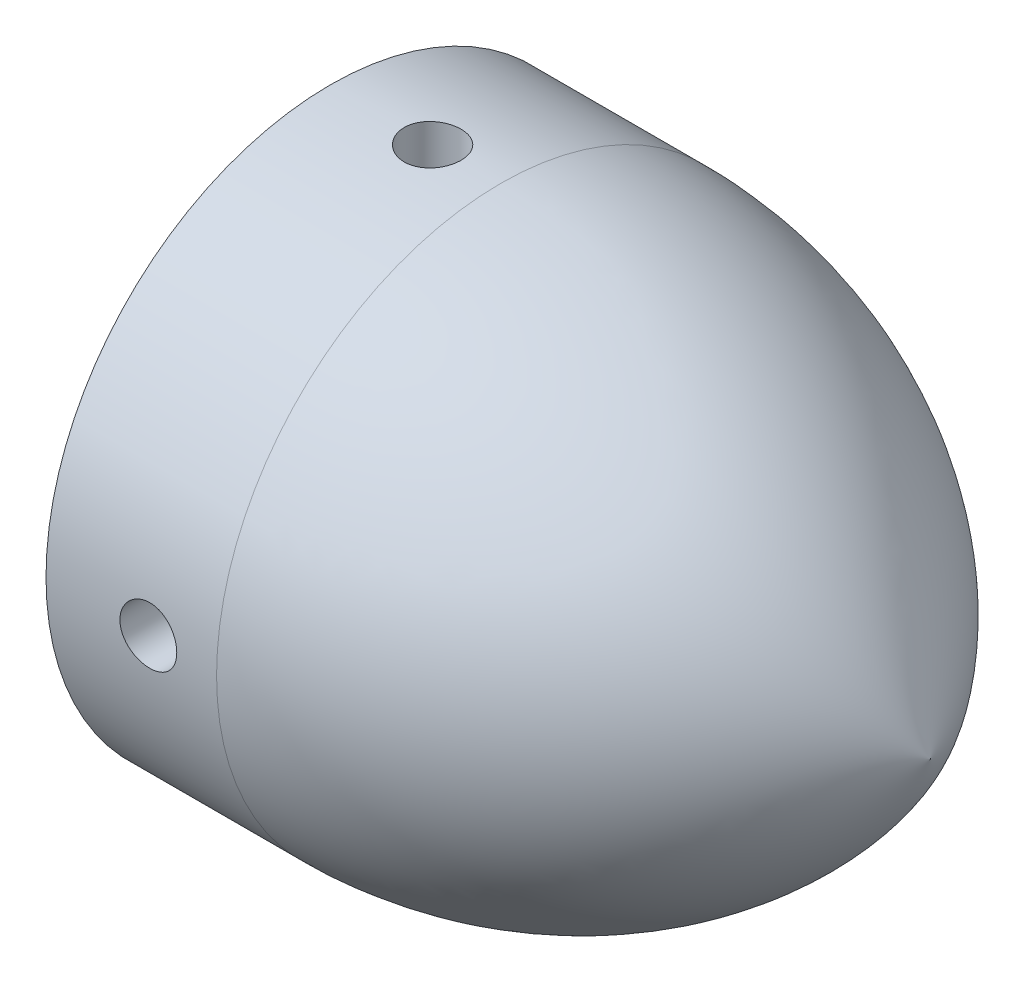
from build123d import *

# Parameters (mm, degrees)
SKETCH2_R             = 40
EXTRUDE1_DEPTH        = 10
M8_TAPPED_HOLE1_D     = 6.8
M8_TAPPED_HOLE1_DEPTH = 20
M8_TAPPED_HOLE1_TIP   = 2.042926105
SKETCH5_R             = 5
EXTRUDE2_DEPTH        = 20
CIRPATTERN1_COUNT     = 4


with BuildPart() as part:
    # Sketch1 → Revolve1 (revolve)
    with BuildSketch(Plane.XY, mode=Mode.PRIVATE) as revolve1_sk:
        with BuildLine():
            Line((0, 0), (105.498344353, 0))
            ThreePointArc((105.498344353, 0), (75.276925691, 36.366658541), (30, 50))
            Line((30, 50), (0, 50))
            Line((0, 50), (0, 0))
        make_face()
    revolve(revolve1_sk.sketch.rotate(Axis((0, 0, 0), (1, 0, 0)), 90), axis=Axis((0, 0, 0), (1, 0, 0)))

    # Sketch2 → Extrude1 (cut)
    with BuildSketch(Plane.ZY):
        Circle(SKETCH2_R)
    extrude(amount=-EXTRUDE1_DEPTH, mode=Mode.SUBTRACT)

    # M8 Tapped Hole1
    with Locations(Plane(origin=(10, 0, 0), x_dir=(0, 0, -1), z_dir=(-1, 0, 0))):
        with Locations((0, 0)):
            Hole(M8_TAPPED_HOLE1_D / 2, depth=M8_TAPPED_HOLE1_DEPTH)
            with Locations((0, 0, -(M8_TAPPED_HOLE1_DEPTH + M8_TAPPED_HOLE1_TIP / 2))):  # 118° drill point
                Cone(0, M8_TAPPED_HOLE1_D / 2, M8_TAPPED_HOLE1_TIP, mode=Mode.SUBTRACT)

    # Sketch5 → Extrude2 (cut)
    with BuildSketch(Plane.XY.offset(50)):
        with Locations((18, 0)):
            Circle(SKETCH5_R)
    extrude2 = extrude(amount=-EXTRUDE2_DEPTH, mode=Mode.SUBTRACT)

    # CirPattern1: Extrude2 ×4 about axis
    cirpattern1_axis = Axis((0, 0, 0), (1, 0, 0))
    for i in range(1, CIRPATTERN1_COUNT):
        add(extrude2.rotate(cirpattern1_axis, i * 360 / CIRPATTERN1_COUNT), mode=Mode.SUBTRACT)


solid = part.part
